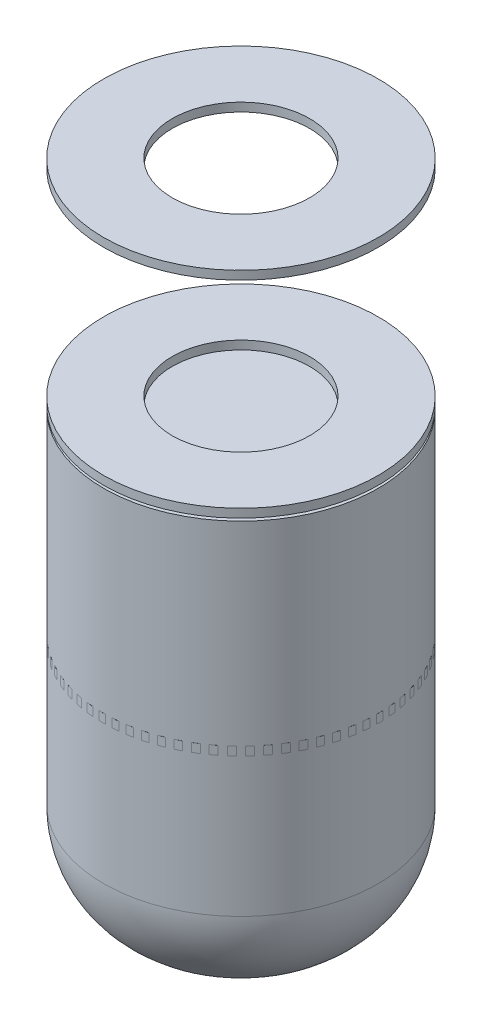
ISO-10303-21;
HEADER;
FILE_DESCRIPTION(('STEP AP214'),'2;1');
FILE_NAME('part.step','',(''),(''),'','','');
FILE_SCHEMA(('AUTOMOTIVE_DESIGN { 1 0 10303 214 1 1 1 1 }'));
ENDSEC;
DATA;
#1=APPLICATION_CONTEXT('core data for automotive mechanical design processes');
#2=APPLICATION_PROTOCOL_DEFINITION('international standard','automotive_design',2000,#1);
#3=PRODUCT_CONTEXT('',#1,'mechanical');
#4=PRODUCT('Part','Part','',(#3));
#5=PRODUCT_RELATED_PRODUCT_CATEGORY('part','',(#4));
#6=PRODUCT_DEFINITION_FORMATION('','',#4);
#7=PRODUCT_DEFINITION_CONTEXT('part definition',#1,'design');
#8=PRODUCT_DEFINITION('design','',#6,#7);
#9=PRODUCT_DEFINITION_SHAPE('','',#8);
#10=(LENGTH_UNIT() NAMED_UNIT(*) SI_UNIT(.MILLI.,.METRE.));
#11=(NAMED_UNIT(*) PLANE_ANGLE_UNIT() SI_UNIT($,.RADIAN.));
#12=(NAMED_UNIT(*) SI_UNIT($,.STERADIAN.) SOLID_ANGLE_UNIT());
#13=UNCERTAINTY_MEASURE_WITH_UNIT(LENGTH_MEASURE(1.E-05),#10,'distance_accuracy_value','');
#14=(GEOMETRIC_REPRESENTATION_CONTEXT(3) GLOBAL_UNCERTAINTY_ASSIGNED_CONTEXT((#13)) GLOBAL_UNIT_ASSIGNED_CONTEXT((#10,
#11,#12)) REPRESENTATION_CONTEXT('',''));
#15=CARTESIAN_POINT('',(0.,0.,0.));
#16=DIRECTION('',(0.,0.,1.));
#17=DIRECTION('',(1.,0.,0.));
#18=AXIS2_PLACEMENT_3D('',#15,#16,#17);
#19=CARTESIAN_POINT('',(0.,-72.0725,0.));
#20=DIRECTION('',(0.,1.,0.));
#21=DIRECTION('',(0.,0.,1.));
#22=AXIS2_PLACEMENT_3D('',#19,#20,#21);
#23=PLANE('',#22);
#24=CARTESIAN_POINT('',(0.,-72.0725,0.));
#25=DIRECTION('',(0.,1.,0.));
#26=DIRECTION('',(0.,0.,1.));
#27=AXIS2_PLACEMENT_3D('',#24,#25,#26);
#28=CIRCLE('',#27,50.8);
#29=CARTESIAN_POINT('',(0.,-72.0725,50.8));
#30=VERTEX_POINT('',#29);
#31=EDGE_CURVE('E11',#30,#30,#28,.T.);
#32=ORIENTED_EDGE('',*,*,#31,.T.);
#33=EDGE_LOOP('',(#32));
#34=FACE_BOUND('',#33,.T.);
#35=CARTESIAN_POINT('',(0.,-72.0725,0.));
#36=DIRECTION('',(0.,1.,0.));
#37=DIRECTION('',(0.,0.,1.));
#38=AXIS2_PLACEMENT_3D('',#35,#36,#37);
#39=CIRCLE('',#38,25.4);
#40=CARTESIAN_POINT('',(0.,-72.0725,25.4));
#41=VERTEX_POINT('',#40);
#42=EDGE_CURVE('E66',#41,#41,#39,.T.);
#43=ORIENTED_EDGE('',*,*,#42,.F.);
#44=EDGE_LOOP('',(#43));
#45=FACE_BOUND('',#44,.T.);
#46=ADVANCED_FACE('F52',(#34,#45),#23,.T.);
#47=CARTESIAN_POINT('',(0.,-75.2475,0.));
#48=DIRECTION('',(0.,1.,0.));
#49=DIRECTION('',(0.,0.,1.));
#50=AXIS2_PLACEMENT_3D('',#47,#48,#49);
#51=PLANE('',#50);
#52=CARTESIAN_POINT('',(0.,-75.2475,0.));
#53=DIRECTION('',(0.,1.,0.));
#54=DIRECTION('',(0.,0.,1.));
#55=AXIS2_PLACEMENT_3D('',#52,#53,#54);
#56=CIRCLE('',#55,50.8);
#57=CARTESIAN_POINT('',(0.,-75.2475,50.8));
#58=VERTEX_POINT('',#57);
#59=EDGE_CURVE('E56',#58,#58,#56,.T.);
#60=ORIENTED_EDGE('',*,*,#59,.F.);
#61=EDGE_LOOP('',(#60));
#62=FACE_BOUND('',#61,.T.);
#63=CARTESIAN_POINT('',(0.,-75.2475,0.));
#64=DIRECTION('',(0.,1.,0.));
#65=DIRECTION('',(0.,0.,1.));
#66=AXIS2_PLACEMENT_3D('',#63,#64,#65);
#67=CIRCLE('',#66,25.4);
#68=CARTESIAN_POINT('',(0.,-75.2475,25.4));
#69=VERTEX_POINT('',#68);
#70=EDGE_CURVE('E68',#69,#69,#67,.T.);
#71=ORIENTED_EDGE('',*,*,#70,.T.);
#72=EDGE_LOOP('',(#71));
#73=FACE_BOUND('',#72,.T.);
#74=ADVANCED_FACE('F81',(#62,#73),#51,.F.);
#75=CARTESIAN_POINT('',(0.,-72.0725,0.));
#76=DIRECTION('',(0.,-1.,0.));
#77=DIRECTION('',(0.,0.,-1.));
#78=AXIS2_PLACEMENT_3D('',#75,#76,#77);
#79=CYLINDRICAL_SURFACE('',#78,50.8);
#80=ORIENTED_EDGE('',*,*,#31,.F.);
#81=EDGE_LOOP('',(#80));
#82=FACE_BOUND('',#81,.T.);
#83=ORIENTED_EDGE('',*,*,#59,.T.);
#84=EDGE_LOOP('',(#83));
#85=FACE_BOUND('',#84,.T.);
#86=ADVANCED_FACE('F54',(#82,#85),#79,.T.);
#87=CARTESIAN_POINT('',(0.,-72.0725,0.));
#88=DIRECTION('',(0.,-1.,0.));
#89=DIRECTION('',(0.,0.,-1.));
#90=AXIS2_PLACEMENT_3D('',#87,#88,#89);
#91=CYLINDRICAL_SURFACE('',#90,25.4);
#92=ORIENTED_EDGE('',*,*,#42,.T.);
#93=EDGE_LOOP('',(#92));
#94=FACE_BOUND('',#93,.T.);
#95=ORIENTED_EDGE('',*,*,#70,.F.);
#96=EDGE_LOOP('',(#95));
#97=FACE_BOUND('',#96,.T.);
#98=ADVANCED_FACE('F77',(#94,#97),#91,.F.);
#99=CLOSED_SHELL('',(#46,#74,#86,#98));
#100=MANIFOLD_SOLID_BREP('B2',#99);
#101=CARTESIAN_POINT('',(0.,80.3275,0.));
#102=DIRECTION('',(0.,1.,0.));
#103=DIRECTION('',(0.,0.,1.));
#104=AXIS2_PLACEMENT_3D('',#101,#102,#103);
#105=PLANE('',#104);
#106=CARTESIAN_POINT('',(0.,80.3275,0.));
#107=DIRECTION('',(0.,1.,0.));
#108=DIRECTION('',(0.,0.,1.));
#109=AXIS2_PLACEMENT_3D('',#106,#107,#108);
#110=CIRCLE('',#109,50.8);
#111=CARTESIAN_POINT('',(0.,80.3275,50.8));
#112=VERTEX_POINT('',#111);
#113=EDGE_CURVE('E51',#112,#112,#110,.T.);
#114=ORIENTED_EDGE('',*,*,#113,.T.);
#115=EDGE_LOOP('',(#114));
#116=FACE_BOUND('',#115,.T.);
#117=CARTESIAN_POINT('',(0.,80.3275,0.));
#118=DIRECTION('',(0.,1.,0.));
#119=DIRECTION('',(0.,0.,1.));
#120=AXIS2_PLACEMENT_3D('',#117,#118,#119);
#121=CIRCLE('',#120,25.4);
#122=CARTESIAN_POINT('',(0.,80.3275,25.4));
#123=VERTEX_POINT('',#122);
#124=EDGE_CURVE('E144',#123,#123,#121,.T.);
#125=ORIENTED_EDGE('',*,*,#124,.F.);
#126=EDGE_LOOP('',(#125));
#127=FACE_BOUND('',#126,.T.);
#128=ADVANCED_FACE('F130',(#116,#127),#105,.T.);
#129=CARTESIAN_POINT('',(0.,77.1525,0.));
#130=DIRECTION('',(0.,1.,0.));
#131=DIRECTION('',(0.,0.,1.));
#132=AXIS2_PLACEMENT_3D('',#129,#130,#131);
#133=PLANE('',#132);
#134=CARTESIAN_POINT('',(0.,77.1525,0.));
#135=DIRECTION('',(0.,1.,0.));
#136=DIRECTION('',(0.,0.,1.));
#137=AXIS2_PLACEMENT_3D('',#134,#135,#136);
#138=CIRCLE('',#137,50.8);
#139=CARTESIAN_POINT('',(0.,77.1525,50.8));
#140=VERTEX_POINT('',#139);
#141=EDGE_CURVE('E134',#140,#140,#138,.T.);
#142=ORIENTED_EDGE('',*,*,#141,.F.);
#143=EDGE_LOOP('',(#142));
#144=FACE_BOUND('',#143,.T.);
#145=CARTESIAN_POINT('',(0.,77.1525,0.));
#146=DIRECTION('',(0.,1.,0.));
#147=DIRECTION('',(0.,0.,1.));
#148=AXIS2_PLACEMENT_3D('',#145,#146,#147);
#149=CIRCLE('',#148,25.4);
#150=CARTESIAN_POINT('',(0.,77.1525,25.4));
#151=VERTEX_POINT('',#150);
#152=EDGE_CURVE('E146',#151,#151,#149,.T.);
#153=ORIENTED_EDGE('',*,*,#152,.T.);
#154=EDGE_LOOP('',(#153));
#155=FACE_BOUND('',#154,.T.);
#156=ADVANCED_FACE('F159',(#144,#155),#133,.F.);
#157=CARTESIAN_POINT('',(0.,80.3275,0.));
#158=DIRECTION('',(0.,-1.,0.));
#159=DIRECTION('',(0.,0.,-1.));
#160=AXIS2_PLACEMENT_3D('',#157,#158,#159);
#161=CYLINDRICAL_SURFACE('',#160,50.8);
#162=ORIENTED_EDGE('',*,*,#113,.F.);
#163=EDGE_LOOP('',(#162));
#164=FACE_BOUND('',#163,.T.);
#165=ORIENTED_EDGE('',*,*,#141,.T.);
#166=EDGE_LOOP('',(#165));
#167=FACE_BOUND('',#166,.T.);
#168=ADVANCED_FACE('F132',(#164,#167),#161,.T.);
#169=CARTESIAN_POINT('',(0.,80.3275,0.));
#170=DIRECTION('',(0.,-1.,0.));
#171=DIRECTION('',(0.,0.,-1.));
#172=AXIS2_PLACEMENT_3D('',#169,#170,#171);
#173=CYLINDRICAL_SURFACE('',#172,25.4);
#174=ORIENTED_EDGE('',*,*,#124,.T.);
#175=EDGE_LOOP('',(#174));
#176=FACE_BOUND('',#175,.T.);
#177=ORIENTED_EDGE('',*,*,#152,.F.);
#178=EDGE_LOOP('',(#177));
#179=FACE_BOUND('',#178,.T.);
#180=ADVANCED_FACE('F155',(#176,#179),#173,.F.);
#181=CLOSED_SHELL('',(#128,#156,#168,#180));
#182=MANIFOLD_SOLID_BREP('B6',#181);
#183=CARTESIAN_POINT('',(0.,4.1275,0.));
#184=DIRECTION('',(0.,1.,0.));
#185=DIRECTION('',(0.,0.,1.));
#186=AXIS2_PLACEMENT_3D('',#183,#184,#185);
#187=PLANE('',#186);
#188=CARTESIAN_POINT('',(0.,4.1275,0.));
#189=DIRECTION('',(0.,1.,0.));
#190=DIRECTION('',(0.,0.,1.));
#191=AXIS2_PLACEMENT_3D('',#188,#189,#190);
#192=CIRCLE('',#191,50.8);
#193=CARTESIAN_POINT('',(0.,4.1275,50.8));
#194=VERTEX_POINT('',#193);
#195=EDGE_CURVE('E129',#194,#194,#192,.T.);
#196=ORIENTED_EDGE('',*,*,#195,.T.);
#197=EDGE_LOOP('',(#196));
#198=FACE_BOUND('',#197,.T.);
#199=CARTESIAN_POINT('',(0.,4.1275,0.));
#200=DIRECTION('',(0.,1.,0.));
#201=DIRECTION('',(0.,0.,1.));
#202=AXIS2_PLACEMENT_3D('',#199,#200,#201);
#203=CIRCLE('',#202,25.4);
#204=CARTESIAN_POINT('',(0.,4.1275,25.4));
#205=VERTEX_POINT('',#204);
#206=EDGE_CURVE('E221',#205,#205,#203,.T.);
#207=ORIENTED_EDGE('',*,*,#206,.F.);
#208=EDGE_LOOP('',(#207));
#209=FACE_BOUND('',#208,.T.);
#210=ADVANCED_FACE('F207',(#198,#209),#187,.T.);
#211=CARTESIAN_POINT('',(0.,0.9525,0.));
#212=DIRECTION('',(0.,1.,0.));
#213=DIRECTION('',(0.,0.,1.));
#214=AXIS2_PLACEMENT_3D('',#211,#212,#213);
#215=PLANE('',#214);
#216=CARTESIAN_POINT('',(0.,0.9525,0.));
#217=DIRECTION('',(0.,1.,0.));
#218=DIRECTION('',(0.,0.,1.));
#219=AXIS2_PLACEMENT_3D('',#216,#217,#218);
#220=CIRCLE('',#219,50.8);
#221=CARTESIAN_POINT('',(0.,0.9525,50.8));
#222=VERTEX_POINT('',#221);
#223=EDGE_CURVE('E211',#222,#222,#220,.T.);
#224=ORIENTED_EDGE('',*,*,#223,.F.);
#225=EDGE_LOOP('',(#224));
#226=FACE_BOUND('',#225,.T.);
#227=CARTESIAN_POINT('',(0.,0.9525,0.));
#228=DIRECTION('',(0.,1.,0.));
#229=DIRECTION('',(0.,0.,1.));
#230=AXIS2_PLACEMENT_3D('',#227,#228,#229);
#231=CIRCLE('',#230,25.4);
#232=CARTESIAN_POINT('',(0.,0.9525,25.4));
#233=VERTEX_POINT('',#232);
#234=EDGE_CURVE('E223',#233,#233,#231,.T.);
#235=ORIENTED_EDGE('',*,*,#234,.T.);
#236=EDGE_LOOP('',(#235));
#237=FACE_BOUND('',#236,.T.);
#238=ADVANCED_FACE('F236',(#226,#237),#215,.F.);
#239=CARTESIAN_POINT('',(0.,4.1275,0.));
#240=DIRECTION('',(0.,-1.,0.));
#241=DIRECTION('',(0.,0.,-1.));
#242=AXIS2_PLACEMENT_3D('',#239,#240,#241);
#243=CYLINDRICAL_SURFACE('',#242,50.8);
#244=ORIENTED_EDGE('',*,*,#195,.F.);
#245=EDGE_LOOP('',(#244));
#246=FACE_BOUND('',#245,.T.);
#247=ORIENTED_EDGE('',*,*,#223,.T.);
#248=EDGE_LOOP('',(#247));
#249=FACE_BOUND('',#248,.T.);
#250=ADVANCED_FACE('F209',(#246,#249),#243,.T.);
#251=CARTESIAN_POINT('',(0.,4.1275,0.));
#252=DIRECTION('',(0.,-1.,0.));
#253=DIRECTION('',(0.,0.,-1.));
#254=AXIS2_PLACEMENT_3D('',#251,#252,#253);
#255=CYLINDRICAL_SURFACE('',#254,25.4);
#256=ORIENTED_EDGE('',*,*,#206,.T.);
#257=EDGE_LOOP('',(#256));
#258=FACE_BOUND('',#257,.T.);
#259=ORIENTED_EDGE('',*,*,#234,.F.);
#260=EDGE_LOOP('',(#259));
#261=FACE_BOUND('',#260,.T.);
#262=ADVANCED_FACE('F232',(#258,#261),#255,.F.);
#263=CLOSED_SHELL('',(#210,#238,#250,#262));
#264=MANIFOLD_SOLID_BREP('B46',#263);
#265=CARTESIAN_POINT('',(0.,-164.719,0.));
#266=DIRECTION('',(0.,-1.,0.));
#267=DIRECTION('',(1.,0.,0.));
#268=AXIS2_PLACEMENT_3D('',#265,#266,#267);
#269=PLANE('',#268);
#270=CARTESIAN_POINT('',(0.,-164.719,0.));
#271=DIRECTION('',(0.,1.,0.));
#272=DIRECTION('',(-1.,0.,0.));
#273=AXIS2_PLACEMENT_3D('',#270,#271,#272);
#274=CIRCLE('',#273,12.7);
#275=CARTESIAN_POINT('',(-12.7,-164.719,0.));
#276=VERTEX_POINT('',#275);
#277=EDGE_CURVE('E206',#276,#276,#274,.T.);
#278=ORIENTED_EDGE('',*,*,#277,.F.);
#279=EDGE_LOOP('',(#278));
#280=FACE_BOUND('',#279,.T.);
#281=ADVANCED_FACE('F277',(#280),#269,.T.);
#282=CARTESIAN_POINT('',(0.,-126.619,0.));
#283=DIRECTION('',(0.,1.,0.));
#284=DIRECTION('',(-1.,0.,0.));
#285=AXIS2_PLACEMENT_3D('',#282,#283,#284);
#286=DEGENERATE_TOROIDAL_SURFACE('',#285,12.7,38.1,.T.);
#287=ORIENTED_EDGE('',*,*,#277,.T.);
#288=EDGE_LOOP('',(#287));
#289=FACE_BOUND('',#288,.T.);
#290=CARTESIAN_POINT('',(0.,-126.619,0.));
#291=DIRECTION('',(0.,1.,0.));
#292=DIRECTION('',(-1.,0.,0.));
#293=AXIS2_PLACEMENT_3D('',#290,#291,#292);
#294=CIRCLE('',#293,50.8);
#295=CARTESIAN_POINT('',(-50.8,-126.619,0.));
#296=VERTEX_POINT('',#295);
#297=EDGE_CURVE('E284',#296,#296,#294,.T.);
#298=ORIENTED_EDGE('',*,*,#297,.F.);
#299=EDGE_LOOP('',(#298));
#300=FACE_BOUND('',#299,.T.);
#301=ADVANCED_FACE('F304',(#289,#300),#286,.T.);
#302=CARTESIAN_POINT('',(0.,164.719,0.));
#303=DIRECTION('',(0.,1.,0.));
#304=DIRECTION('',(-1.,0.,0.));
#305=AXIS2_PLACEMENT_3D('',#302,#303,#304);
#306=CYLINDRICAL_SURFACE('',#305,50.8);
#307=ORIENTED_EDGE('',*,*,#297,.T.);
#308=EDGE_LOOP('',(#307));
#309=FACE_BOUND('',#308,.T.);
#310=CARTESIAN_POINT('',(0.,0.,0.));
#311=DIRECTION('',(0.,1.,0.));
#312=DIRECTION('',(-1.,0.,0.));
#313=AXIS2_PLACEMENT_3D('',#310,#311,#312);
#314=CIRCLE('',#313,50.8);
#315=CARTESIAN_POINT('',(-50.8,0.,0.));
#316=VERTEX_POINT('',#315);
#317=EDGE_CURVE('E290',#316,#316,#314,.T.);
#318=ORIENTED_EDGE('',*,*,#317,.F.);
#319=EDGE_LOOP('',(#318));
#320=FACE_BOUND('',#319,.T.);
#321=ADVANCED_FACE('F302',(#309,#320),#306,.T.);
#322=CARTESIAN_POINT('',(-50.8,0.,0.));
#323=DIRECTION('',(0.,1.,0.));
#324=DIRECTION('',(-1.,0.,0.));
#325=AXIS2_PLACEMENT_3D('',#322,#323,#324);
#326=PLANE('',#325);
#327=ORIENTED_EDGE('',*,*,#317,.T.);
#328=EDGE_LOOP('',(#327));
#329=FACE_BOUND('',#328,.T.);
#330=ADVANCED_FACE('F300',(#329),#326,.T.);
#331=CLOSED_SHELL('',(#281,#301,#321,#330));
#332=MANIFOLD_SOLID_BREP('B124',#331);
#333=ADVANCED_BREP_SHAPE_REPRESENTATION('',(#18,#100,#182,#264,#332),#14);
#334=SHAPE_DEFINITION_REPRESENTATION(#9,#333);
ENDSEC;
END-ISO-10303-21;
